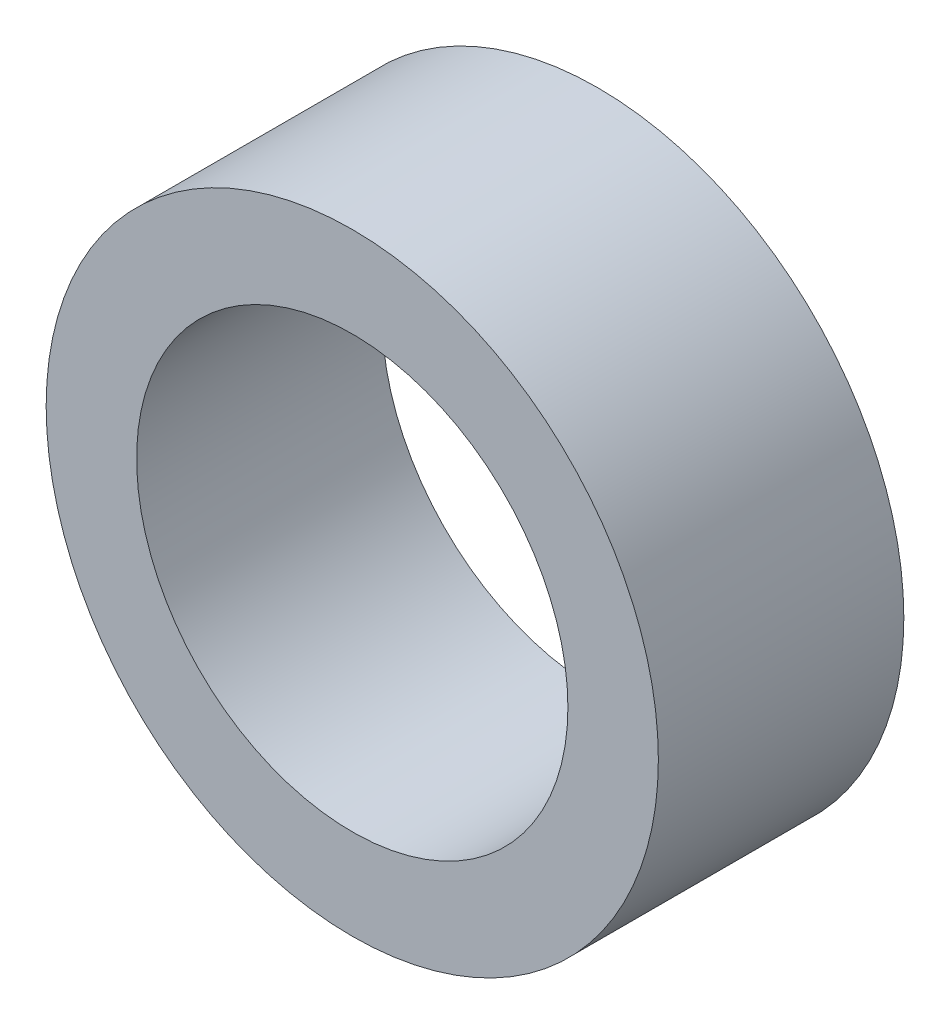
ISO-10303-21;
HEADER;
FILE_DESCRIPTION(('STEP AP214'),'2;1');
FILE_NAME('part.step','',(''),(''),'','','');
FILE_SCHEMA(('AUTOMOTIVE_DESIGN { 1 0 10303 214 1 1 1 1 }'));
ENDSEC;
DATA;
#1=APPLICATION_CONTEXT('core data for automotive mechanical design processes');
#2=APPLICATION_PROTOCOL_DEFINITION('international standard','automotive_design',2000,#1);
#3=PRODUCT_CONTEXT('',#1,'mechanical');
#4=PRODUCT('Part','Part','',(#3));
#5=PRODUCT_RELATED_PRODUCT_CATEGORY('part','',(#4));
#6=PRODUCT_DEFINITION_FORMATION('','',#4);
#7=PRODUCT_DEFINITION_CONTEXT('part definition',#1,'design');
#8=PRODUCT_DEFINITION('design','',#6,#7);
#9=PRODUCT_DEFINITION_SHAPE('','',#8);
#10=(LENGTH_UNIT() NAMED_UNIT(*) SI_UNIT(.MILLI.,.METRE.));
#11=(NAMED_UNIT(*) PLANE_ANGLE_UNIT() SI_UNIT($,.RADIAN.));
#12=(NAMED_UNIT(*) SI_UNIT($,.STERADIAN.) SOLID_ANGLE_UNIT());
#13=UNCERTAINTY_MEASURE_WITH_UNIT(LENGTH_MEASURE(1.E-05),#10,'distance_accuracy_value','');
#14=(GEOMETRIC_REPRESENTATION_CONTEXT(3) GLOBAL_UNCERTAINTY_ASSIGNED_CONTEXT((#13)) GLOBAL_UNIT_ASSIGNED_CONTEXT((#10,
#11,#12)) REPRESENTATION_CONTEXT('',''));
#15=CARTESIAN_POINT('',(0.,0.,0.));
#16=DIRECTION('',(0.,0.,1.));
#17=DIRECTION('',(1.,0.,0.));
#18=AXIS2_PLACEMENT_3D('',#15,#16,#17);
#19=CARTESIAN_POINT('',(0.,0.,12.6492));
#20=DIRECTION('',(0.,0.,1.));
#21=DIRECTION('',(1.,0.,0.));
#22=AXIS2_PLACEMENT_3D('',#19,#20,#21);
#23=PLANE('',#22);
#24=CARTESIAN_POINT('',(0.,0.,12.6492));
#25=DIRECTION('',(0.,0.,1.));
#26=DIRECTION('',(1.,0.,0.));
#27=AXIS2_PLACEMENT_3D('',#24,#25,#26);
#28=CIRCLE('',#27,15.7734);
#29=CARTESIAN_POINT('',(15.7734,0.,12.6492));
#30=VERTEX_POINT('',#29);
#31=EDGE_CURVE('E10',#30,#30,#28,.T.);
#32=ORIENTED_EDGE('',*,*,#31,.T.);
#33=EDGE_LOOP('',(#32));
#34=FACE_BOUND('',#33,.T.);
#35=CARTESIAN_POINT('',(0.,0.,12.6492));
#36=DIRECTION('',(0.,0.,1.));
#37=DIRECTION('',(1.,0.,0.));
#38=AXIS2_PLACEMENT_3D('',#35,#36,#37);
#39=CIRCLE('',#38,11.1125);
#40=CARTESIAN_POINT('',(11.1125,0.,12.6492));
#41=VERTEX_POINT('',#40);
#42=EDGE_CURVE('E44',#41,#41,#39,.T.);
#43=ORIENTED_EDGE('',*,*,#42,.F.);
#44=EDGE_LOOP('',(#43));
#45=FACE_BOUND('',#44,.T.);
#46=ADVANCED_FACE('F33',(#34,#45),#23,.T.);
#47=CARTESIAN_POINT('',(0.,0.,0.));
#48=DIRECTION('',(0.,0.,1.));
#49=DIRECTION('',(1.,0.,0.));
#50=AXIS2_PLACEMENT_3D('',#47,#48,#49);
#51=PLANE('',#50);
#52=CARTESIAN_POINT('',(0.,0.,0.));
#53=DIRECTION('',(0.,0.,1.));
#54=DIRECTION('',(1.,0.,0.));
#55=AXIS2_PLACEMENT_3D('',#52,#53,#54);
#56=CIRCLE('',#55,15.7734);
#57=CARTESIAN_POINT('',(15.7734,0.,0.));
#58=VERTEX_POINT('',#57);
#59=EDGE_CURVE('E37',#58,#58,#56,.T.);
#60=ORIENTED_EDGE('',*,*,#59,.F.);
#61=EDGE_LOOP('',(#60));
#62=FACE_BOUND('',#61,.T.);
#63=CARTESIAN_POINT('',(0.,0.,0.));
#64=DIRECTION('',(0.,0.,1.));
#65=DIRECTION('',(1.,0.,0.));
#66=AXIS2_PLACEMENT_3D('',#63,#64,#65);
#67=CIRCLE('',#66,11.1125);
#68=CARTESIAN_POINT('',(11.1125,0.,0.));
#69=VERTEX_POINT('',#68);
#70=EDGE_CURVE('E46',#69,#69,#67,.T.);
#71=ORIENTED_EDGE('',*,*,#70,.T.);
#72=EDGE_LOOP('',(#71));
#73=FACE_BOUND('',#72,.T.);
#74=ADVANCED_FACE('F56',(#62,#73),#51,.F.);
#75=CARTESIAN_POINT('',(0.,0.,12.6492));
#76=DIRECTION('',(0.,0.,-1.));
#77=DIRECTION('',(-1.,0.,0.));
#78=AXIS2_PLACEMENT_3D('',#75,#76,#77);
#79=CYLINDRICAL_SURFACE('',#78,15.7734);
#80=ORIENTED_EDGE('',*,*,#31,.F.);
#81=EDGE_LOOP('',(#80));
#82=FACE_BOUND('',#81,.T.);
#83=ORIENTED_EDGE('',*,*,#59,.T.);
#84=EDGE_LOOP('',(#83));
#85=FACE_BOUND('',#84,.T.);
#86=ADVANCED_FACE('F35',(#82,#85),#79,.T.);
#87=CARTESIAN_POINT('',(0.,0.,12.6492));
#88=DIRECTION('',(0.,0.,-1.));
#89=DIRECTION('',(-1.,0.,0.));
#90=AXIS2_PLACEMENT_3D('',#87,#88,#89);
#91=CYLINDRICAL_SURFACE('',#90,11.1125);
#92=ORIENTED_EDGE('',*,*,#42,.T.);
#93=EDGE_LOOP('',(#92));
#94=FACE_BOUND('',#93,.T.);
#95=ORIENTED_EDGE('',*,*,#70,.F.);
#96=EDGE_LOOP('',(#95));
#97=FACE_BOUND('',#96,.T.);
#98=ADVANCED_FACE('F52',(#94,#97),#91,.F.);
#99=CLOSED_SHELL('',(#46,#74,#86,#98));
#100=MANIFOLD_SOLID_BREP('B2',#99);
#101=ADVANCED_BREP_SHAPE_REPRESENTATION('',(#18,#100),#14);
#102=SHAPE_DEFINITION_REPRESENTATION(#9,#101);
ENDSEC;
END-ISO-10303-21;
